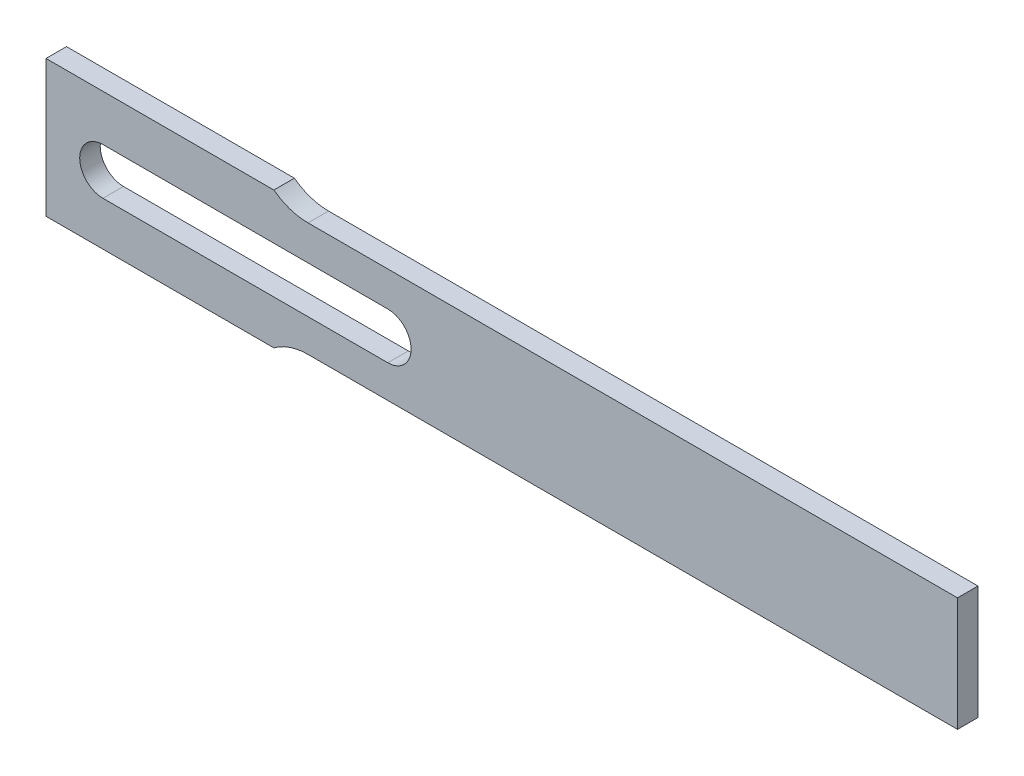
ISO-10303-21;
HEADER;
FILE_DESCRIPTION(('STEP AP214'),'2;1');
FILE_NAME('part.step','',(''),(''),'','','');
FILE_SCHEMA(('AUTOMOTIVE_DESIGN { 1 0 10303 214 1 1 1 1 }'));
ENDSEC;
DATA;
#1=APPLICATION_CONTEXT('core data for automotive mechanical design processes');
#2=APPLICATION_PROTOCOL_DEFINITION('international standard','automotive_design',2000,#1);
#3=PRODUCT_CONTEXT('',#1,'mechanical');
#4=PRODUCT('Part','Part','',(#3));
#5=PRODUCT_RELATED_PRODUCT_CATEGORY('part','',(#4));
#6=PRODUCT_DEFINITION_FORMATION('','',#4);
#7=PRODUCT_DEFINITION_CONTEXT('part definition',#1,'design');
#8=PRODUCT_DEFINITION('design','',#6,#7);
#9=PRODUCT_DEFINITION_SHAPE('','',#8);
#10=(LENGTH_UNIT() NAMED_UNIT(*) SI_UNIT(.MILLI.,.METRE.));
#11=(NAMED_UNIT(*) PLANE_ANGLE_UNIT() SI_UNIT($,.RADIAN.));
#12=(NAMED_UNIT(*) SI_UNIT($,.STERADIAN.) SOLID_ANGLE_UNIT());
#13=UNCERTAINTY_MEASURE_WITH_UNIT(LENGTH_MEASURE(1.E-05),#10,'distance_accuracy_value','');
#14=(GEOMETRIC_REPRESENTATION_CONTEXT(3) GLOBAL_UNCERTAINTY_ASSIGNED_CONTEXT((#13)) GLOBAL_UNIT_ASSIGNED_CONTEXT((#10,
#11,#12)) REPRESENTATION_CONTEXT('',''));
#15=CARTESIAN_POINT('',(0.,0.,0.));
#16=DIRECTION('',(0.,0.,1.));
#17=DIRECTION('',(1.,0.,0.));
#18=AXIS2_PLACEMENT_3D('',#15,#16,#17);
#19=CARTESIAN_POINT('',(23.,9.99999999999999,1.8));
#20=DIRECTION('',(0.,0.,1.));
#21=DIRECTION('',(1.,0.,0.));
#22=AXIS2_PLACEMENT_3D('',#19,#20,#21);
#23=PLANE('',#22);
#24=DIRECTION('',(0.,-1.,0.));
#25=VECTOR('',#24,1.);
#26=CARTESIAN_POINT('',(0.,-6.,1.8));
#27=LINE('',#26,#25);
#28=CARTESIAN_POINT('',(0.,6.,1.8));
#29=VERTEX_POINT('',#28);
#30=CARTESIAN_POINT('',(0.,-6.,1.8));
#31=VERTEX_POINT('',#30);
#32=EDGE_CURVE('E161',#29,#31,#27,.T.);
#33=ORIENTED_EDGE('',*,*,#32,.T.);
#34=DIRECTION('',(1.,0.,0.));
#35=VECTOR('',#34,1.);
#36=CARTESIAN_POINT('',(0.,-6.,1.8));
#37=LINE('',#36,#35);
#38=CARTESIAN_POINT('',(20.,-6.,1.8));
#39=VERTEX_POINT('',#38);
#40=EDGE_CURVE('E164',#31,#39,#37,.T.);
#41=ORIENTED_EDGE('',*,*,#40,.T.);
#42=CARTESIAN_POINT('',(23.,-9.99999999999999,1.8));
#43=DIRECTION('',(0.,0.,-1.));
#44=DIRECTION('',(1.,0.,0.));
#45=AXIS2_PLACEMENT_3D('',#42,#43,#44);
#46=CIRCLE('',#45,4.99999999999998);
#47=CARTESIAN_POINT('',(23.,-5.00000000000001,1.8));
#48=VERTEX_POINT('',#47);
#49=EDGE_CURVE('E167',#39,#48,#46,.T.);
#50=ORIENTED_EDGE('',*,*,#49,.T.);
#51=DIRECTION('',(1.,0.,0.));
#52=VECTOR('',#51,1.);
#53=CARTESIAN_POINT('',(80.,-5.00000000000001,1.8));
#54=LINE('',#53,#52);
#55=CARTESIAN_POINT('',(80.,-5.00000000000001,1.8));
#56=VERTEX_POINT('',#55);
#57=EDGE_CURVE('E169',#48,#56,#54,.T.);
#58=ORIENTED_EDGE('',*,*,#57,.T.);
#59=DIRECTION('',(0.,1.,0.));
#60=VECTOR('',#59,1.);
#61=CARTESIAN_POINT('',(80.,-5.00000000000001,1.8));
#62=LINE('',#61,#60);
#63=CARTESIAN_POINT('',(80.,4.99999999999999,1.8));
#64=VERTEX_POINT('',#63);
#65=EDGE_CURVE('E171',#56,#64,#62,.T.);
#66=ORIENTED_EDGE('',*,*,#65,.T.);
#67=DIRECTION('',(-1.,0.,0.));
#68=VECTOR('',#67,1.);
#69=CARTESIAN_POINT('',(80.,4.99999999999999,1.8));
#70=LINE('',#69,#68);
#71=CARTESIAN_POINT('',(23.,4.99999999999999,1.8));
#72=VERTEX_POINT('',#71);
#73=EDGE_CURVE('E173',#64,#72,#70,.T.);
#74=ORIENTED_EDGE('',*,*,#73,.T.);
#75=CARTESIAN_POINT('',(23.,9.99999999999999,1.8));
#76=DIRECTION('',(0.,0.,-1.));
#77=DIRECTION('',(1.,0.,0.));
#78=AXIS2_PLACEMENT_3D('',#75,#76,#77);
#79=CIRCLE('',#78,5.);
#80=CARTESIAN_POINT('',(20.,6.,1.8));
#81=VERTEX_POINT('',#80);
#82=EDGE_CURVE('E175',#72,#81,#79,.T.);
#83=ORIENTED_EDGE('',*,*,#82,.T.);
#84=DIRECTION('',(-1.,0.,0.));
#85=VECTOR('',#84,1.);
#86=CARTESIAN_POINT('',(0.,6.,1.8));
#87=LINE('',#86,#85);
#88=EDGE_CURVE('E177',#81,#29,#87,.T.);
#89=ORIENTED_EDGE('',*,*,#88,.T.);
#90=EDGE_LOOP('',(#33,#41,#50,#58,#66,#74,#83,#89));
#91=FACE_BOUND('',#90,.T.);
#92=DIRECTION('',(1.,0.,0.));
#93=VECTOR('',#92,1.);
#94=CARTESIAN_POINT('',(5.,-2.13081517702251,1.8));
#95=LINE('',#94,#93);
#96=CARTESIAN_POINT('',(5.,-2.13081517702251,1.8));
#97=VERTEX_POINT('',#96);
#98=CARTESIAN_POINT('',(30.,-2.13081517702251,1.8));
#99=VERTEX_POINT('',#98);
#100=EDGE_CURVE('E133',#97,#99,#95,.T.);
#101=ORIENTED_EDGE('',*,*,#100,.F.);
#102=CARTESIAN_POINT('',(5.,-0.0887839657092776,1.8));
#103=DIRECTION('',(0.,0.,1.));
#104=DIRECTION('',(1.,0.,0.));
#105=AXIS2_PLACEMENT_3D('',#102,#103,#104);
#106=CIRCLE('',#105,2.04203121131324);
#107=CARTESIAN_POINT('',(5.,1.95324724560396,1.8));
#108=VERTEX_POINT('',#107);
#109=EDGE_CURVE('E125',#108,#97,#106,.T.);
#110=ORIENTED_EDGE('',*,*,#109,.F.);
#111=DIRECTION('',(-1.,0.,0.));
#112=VECTOR('',#111,1.);
#113=CARTESIAN_POINT('',(5.,1.95324724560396,1.8));
#114=LINE('',#113,#112);
#115=CARTESIAN_POINT('',(30.,1.95324724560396,1.8));
#116=VERTEX_POINT('',#115);
#117=EDGE_CURVE('E147',#116,#108,#114,.T.);
#118=ORIENTED_EDGE('',*,*,#117,.F.);
#119=CARTESIAN_POINT('',(30.,-0.0887839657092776,1.8));
#120=DIRECTION('',(0.,0.,1.));
#121=DIRECTION('',(1.,0.,0.));
#122=AXIS2_PLACEMENT_3D('',#119,#120,#121);
#123=CIRCLE('',#122,2.04203121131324);
#124=EDGE_CURVE('E145',#99,#116,#123,.T.);
#125=ORIENTED_EDGE('',*,*,#124,.F.);
#126=EDGE_LOOP('',(#101,#110,#118,#125));
#127=FACE_BOUND('',#126,.T.);
#128=ADVANCED_FACE('F36',(#91,#127),#23,.T.);
#129=CARTESIAN_POINT('',(23.,9.99999999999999,0.));
#130=DIRECTION('',(0.,0.,1.));
#131=DIRECTION('',(1.,0.,0.));
#132=AXIS2_PLACEMENT_3D('',#129,#130,#131);
#133=PLANE('',#132);
#134=DIRECTION('',(0.,-1.,0.));
#135=VECTOR('',#134,1.);
#136=CARTESIAN_POINT('',(0.,-6.,0.));
#137=LINE('',#136,#135);
#138=CARTESIAN_POINT('',(0.,6.,0.));
#139=VERTEX_POINT('',#138);
#140=CARTESIAN_POINT('',(0.,-6.,0.));
#141=VERTEX_POINT('',#140);
#142=EDGE_CURVE('E141',#139,#141,#137,.T.);
#143=ORIENTED_EDGE('',*,*,#142,.F.);
#144=DIRECTION('',(-1.,0.,0.));
#145=VECTOR('',#144,1.);
#146=CARTESIAN_POINT('',(0.,6.,0.));
#147=LINE('',#146,#145);
#148=CARTESIAN_POINT('',(20.,6.,0.));
#149=VERTEX_POINT('',#148);
#150=EDGE_CURVE('E165',#149,#139,#147,.T.);
#151=ORIENTED_EDGE('',*,*,#150,.F.);
#152=CARTESIAN_POINT('',(23.,9.99999999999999,0.));
#153=DIRECTION('',(0.,0.,-1.));
#154=DIRECTION('',(1.,0.,0.));
#155=AXIS2_PLACEMENT_3D('',#152,#153,#154);
#156=CIRCLE('',#155,5.);
#157=CARTESIAN_POINT('',(23.,4.99999999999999,0.));
#158=VERTEX_POINT('',#157);
#159=EDGE_CURVE('E192',#158,#149,#156,.T.);
#160=ORIENTED_EDGE('',*,*,#159,.F.);
#161=DIRECTION('',(-1.,0.,0.));
#162=VECTOR('',#161,1.);
#163=CARTESIAN_POINT('',(80.,4.99999999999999,0.));
#164=LINE('',#163,#162);
#165=CARTESIAN_POINT('',(80.,4.99999999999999,0.));
#166=VERTEX_POINT('',#165);
#167=EDGE_CURVE('E190',#166,#158,#164,.T.);
#168=ORIENTED_EDGE('',*,*,#167,.F.);
#169=DIRECTION('',(0.,1.,0.));
#170=VECTOR('',#169,1.);
#171=CARTESIAN_POINT('',(80.,-5.00000000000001,0.));
#172=LINE('',#171,#170);
#173=CARTESIAN_POINT('',(80.,-5.00000000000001,0.));
#174=VERTEX_POINT('',#173);
#175=EDGE_CURVE('E188',#174,#166,#172,.T.);
#176=ORIENTED_EDGE('',*,*,#175,.F.);
#177=DIRECTION('',(1.,0.,0.));
#178=VECTOR('',#177,1.);
#179=CARTESIAN_POINT('',(80.,-5.00000000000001,0.));
#180=LINE('',#179,#178);
#181=CARTESIAN_POINT('',(23.,-5.00000000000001,0.));
#182=VERTEX_POINT('',#181);
#183=EDGE_CURVE('E186',#182,#174,#180,.T.);
#184=ORIENTED_EDGE('',*,*,#183,.F.);
#185=CARTESIAN_POINT('',(23.,-9.99999999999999,0.));
#186=DIRECTION('',(0.,0.,-1.));
#187=DIRECTION('',(1.,0.,0.));
#188=AXIS2_PLACEMENT_3D('',#185,#186,#187);
#189=CIRCLE('',#188,4.99999999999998);
#190=CARTESIAN_POINT('',(20.,-6.,0.));
#191=VERTEX_POINT('',#190);
#192=EDGE_CURVE('E184',#191,#182,#189,.T.);
#193=ORIENTED_EDGE('',*,*,#192,.F.);
#194=DIRECTION('',(1.,0.,0.));
#195=VECTOR('',#194,1.);
#196=CARTESIAN_POINT('',(0.,-6.,0.));
#197=LINE('',#196,#195);
#198=EDGE_CURVE('E182',#141,#191,#197,.T.);
#199=ORIENTED_EDGE('',*,*,#198,.F.);
#200=EDGE_LOOP('',(#143,#151,#160,#168,#176,#184,#193,#199));
#201=FACE_BOUND('',#200,.T.);
#202=CARTESIAN_POINT('',(5.,-0.0887839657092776,0.));
#203=DIRECTION('',(0.,0.,1.));
#204=DIRECTION('',(1.,0.,0.));
#205=AXIS2_PLACEMENT_3D('',#202,#203,#204);
#206=CIRCLE('',#205,2.04203121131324);
#207=CARTESIAN_POINT('',(5.,1.95324724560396,0.));
#208=VERTEX_POINT('',#207);
#209=CARTESIAN_POINT('',(5.,-2.13081517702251,0.));
#210=VERTEX_POINT('',#209);
#211=EDGE_CURVE('E59',#208,#210,#206,.T.);
#212=ORIENTED_EDGE('',*,*,#211,.T.);
#213=DIRECTION('',(1.,0.,0.));
#214=VECTOR('',#213,1.);
#215=CARTESIAN_POINT('',(5.,-2.13081517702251,0.));
#216=LINE('',#215,#214);
#217=CARTESIAN_POINT('',(30.,-2.13081517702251,0.));
#218=VERTEX_POINT('',#217);
#219=EDGE_CURVE('E140',#210,#218,#216,.T.);
#220=ORIENTED_EDGE('',*,*,#219,.T.);
#221=CARTESIAN_POINT('',(30.,-0.0887839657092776,0.));
#222=DIRECTION('',(0.,0.,1.));
#223=DIRECTION('',(1.,0.,0.));
#224=AXIS2_PLACEMENT_3D('',#221,#222,#223);
#225=CIRCLE('',#224,2.04203121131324);
#226=CARTESIAN_POINT('',(30.,1.95324724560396,0.));
#227=VERTEX_POINT('',#226);
#228=EDGE_CURVE('E153',#218,#227,#225,.T.);
#229=ORIENTED_EDGE('',*,*,#228,.T.);
#230=DIRECTION('',(-1.,0.,0.));
#231=VECTOR('',#230,1.);
#232=CARTESIAN_POINT('',(5.,1.95324724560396,0.));
#233=LINE('',#232,#231);
#234=EDGE_CURVE('E134',#227,#208,#233,.T.);
#235=ORIENTED_EDGE('',*,*,#234,.T.);
#236=EDGE_LOOP('',(#212,#220,#229,#235));
#237=FACE_BOUND('',#236,.T.);
#238=ADVANCED_FACE('F222',(#201,#237),#133,.F.);
#239=CARTESIAN_POINT('',(0.,-6.,1.8));
#240=DIRECTION('',(1.,0.,0.));
#241=DIRECTION('',(0.,0.,-1.));
#242=AXIS2_PLACEMENT_3D('',#239,#240,#241);
#243=PLANE('',#242);
#244=ORIENTED_EDGE('',*,*,#142,.T.);
#245=DIRECTION('',(0.,0.,-1.));
#246=VECTOR('',#245,1.);
#247=CARTESIAN_POINT('',(0.,-6.,1.8));
#248=LINE('',#247,#246);
#249=EDGE_CURVE('E11',#31,#141,#248,.T.);
#250=ORIENTED_EDGE('',*,*,#249,.F.);
#251=ORIENTED_EDGE('',*,*,#32,.F.);
#252=DIRECTION('',(0.,0.,-1.));
#253=VECTOR('',#252,1.);
#254=CARTESIAN_POINT('',(0.,6.,1.8));
#255=LINE('',#254,#253);
#256=EDGE_CURVE('E179',#29,#139,#255,.T.);
#257=ORIENTED_EDGE('',*,*,#256,.T.);
#258=EDGE_LOOP('',(#244,#250,#251,#257));
#259=FACE_BOUND('',#258,.T.);
#260=ADVANCED_FACE('F38',(#259),#243,.F.);
#261=CARTESIAN_POINT('',(0.,-6.,1.8));
#262=DIRECTION('',(0.,1.,0.));
#263=DIRECTION('',(0.,0.,1.));
#264=AXIS2_PLACEMENT_3D('',#261,#262,#263);
#265=PLANE('',#264);
#266=ORIENTED_EDGE('',*,*,#198,.T.);
#267=DIRECTION('',(0.,0.,-1.));
#268=VECTOR('',#267,1.);
#269=CARTESIAN_POINT('',(20.,-6.,1.8));
#270=LINE('',#269,#268);
#271=EDGE_CURVE('E44',#39,#191,#270,.T.);
#272=ORIENTED_EDGE('',*,*,#271,.F.);
#273=ORIENTED_EDGE('',*,*,#40,.F.);
#274=ORIENTED_EDGE('',*,*,#249,.T.);
#275=EDGE_LOOP('',(#266,#272,#273,#274));
#276=FACE_BOUND('',#275,.T.);
#277=ADVANCED_FACE('F239',(#276),#265,.F.);
#278=CARTESIAN_POINT('',(23.,-9.99999999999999,1.8));
#279=DIRECTION('',(0.,0.,-1.));
#280=DIRECTION('',(-1.,0.,0.));
#281=AXIS2_PLACEMENT_3D('',#278,#279,#280);
#282=CYLINDRICAL_SURFACE('',#281,4.99999999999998);
#283=ORIENTED_EDGE('',*,*,#192,.T.);
#284=DIRECTION('',(0.,0.,-1.));
#285=VECTOR('',#284,1.);
#286=CARTESIAN_POINT('',(23.,-5.00000000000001,1.8));
#287=LINE('',#286,#285);
#288=EDGE_CURVE('E209',#48,#182,#287,.T.);
#289=ORIENTED_EDGE('',*,*,#288,.F.);
#290=ORIENTED_EDGE('',*,*,#49,.F.);
#291=ORIENTED_EDGE('',*,*,#271,.T.);
#292=EDGE_LOOP('',(#283,#289,#290,#291));
#293=FACE_BOUND('',#292,.T.);
#294=ADVANCED_FACE('F216',(#293),#282,.F.);
#295=CARTESIAN_POINT('',(80.,-5.00000000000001,1.8));
#296=DIRECTION('',(0.,1.,0.));
#297=DIRECTION('',(-1.,0.,0.));
#298=AXIS2_PLACEMENT_3D('',#295,#296,#297);
#299=PLANE('',#298);
#300=ORIENTED_EDGE('',*,*,#183,.T.);
#301=DIRECTION('',(0.,0.,-1.));
#302=VECTOR('',#301,1.);
#303=CARTESIAN_POINT('',(80.,-5.00000000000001,1.8));
#304=LINE('',#303,#302);
#305=EDGE_CURVE('E206',#56,#174,#304,.T.);
#306=ORIENTED_EDGE('',*,*,#305,.F.);
#307=ORIENTED_EDGE('',*,*,#57,.F.);
#308=ORIENTED_EDGE('',*,*,#288,.T.);
#309=EDGE_LOOP('',(#300,#306,#307,#308));
#310=FACE_BOUND('',#309,.T.);
#311=ADVANCED_FACE('F228',(#310),#299,.F.);
#312=CARTESIAN_POINT('',(80.,-5.00000000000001,1.8));
#313=DIRECTION('',(-1.,0.,0.));
#314=DIRECTION('',(0.,0.,1.));
#315=AXIS2_PLACEMENT_3D('',#312,#313,#314);
#316=PLANE('',#315);
#317=ORIENTED_EDGE('',*,*,#175,.T.);
#318=DIRECTION('',(0.,0.,-1.));
#319=VECTOR('',#318,1.);
#320=CARTESIAN_POINT('',(80.,4.99999999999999,1.8));
#321=LINE('',#320,#319);
#322=EDGE_CURVE('E203',#64,#166,#321,.T.);
#323=ORIENTED_EDGE('',*,*,#322,.F.);
#324=ORIENTED_EDGE('',*,*,#65,.F.);
#325=ORIENTED_EDGE('',*,*,#305,.T.);
#326=EDGE_LOOP('',(#317,#323,#324,#325));
#327=FACE_BOUND('',#326,.T.);
#328=ADVANCED_FACE('F232',(#327),#316,.F.);
#329=CARTESIAN_POINT('',(80.,4.99999999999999,1.8));
#330=DIRECTION('',(0.,-1.,0.));
#331=DIRECTION('',(1.,0.,0.));
#332=AXIS2_PLACEMENT_3D('',#329,#330,#331);
#333=PLANE('',#332);
#334=ORIENTED_EDGE('',*,*,#167,.T.);
#335=DIRECTION('',(0.,0.,-1.));
#336=VECTOR('',#335,1.);
#337=CARTESIAN_POINT('',(23.,4.99999999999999,1.8));
#338=LINE('',#337,#336);
#339=EDGE_CURVE('E200',#72,#158,#338,.T.);
#340=ORIENTED_EDGE('',*,*,#339,.F.);
#341=ORIENTED_EDGE('',*,*,#73,.F.);
#342=ORIENTED_EDGE('',*,*,#322,.T.);
#343=EDGE_LOOP('',(#334,#340,#341,#342));
#344=FACE_BOUND('',#343,.T.);
#345=ADVANCED_FACE('F252',(#344),#333,.F.);
#346=CARTESIAN_POINT('',(23.,9.99999999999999,1.8));
#347=DIRECTION('',(0.,0.,-1.));
#348=DIRECTION('',(-1.,0.,0.));
#349=AXIS2_PLACEMENT_3D('',#346,#347,#348);
#350=CYLINDRICAL_SURFACE('',#349,5.);
#351=ORIENTED_EDGE('',*,*,#159,.T.);
#352=DIRECTION('',(0.,0.,-1.));
#353=VECTOR('',#352,1.);
#354=CARTESIAN_POINT('',(20.,6.,1.8));
#355=LINE('',#354,#353);
#356=EDGE_CURVE('E197',#81,#149,#355,.T.);
#357=ORIENTED_EDGE('',*,*,#356,.F.);
#358=ORIENTED_EDGE('',*,*,#82,.F.);
#359=ORIENTED_EDGE('',*,*,#339,.T.);
#360=EDGE_LOOP('',(#351,#357,#358,#359));
#361=FACE_BOUND('',#360,.T.);
#362=ADVANCED_FACE('F250',(#361),#350,.F.);
#363=CARTESIAN_POINT('',(0.,6.,1.8));
#364=DIRECTION('',(0.,-1.,0.));
#365=DIRECTION('',(0.,0.,-1.));
#366=AXIS2_PLACEMENT_3D('',#363,#364,#365);
#367=PLANE('',#366);
#368=ORIENTED_EDGE('',*,*,#150,.T.);
#369=ORIENTED_EDGE('',*,*,#256,.F.);
#370=ORIENTED_EDGE('',*,*,#88,.F.);
#371=ORIENTED_EDGE('',*,*,#356,.T.);
#372=EDGE_LOOP('',(#368,#369,#370,#371));
#373=FACE_BOUND('',#372,.T.);
#374=ADVANCED_FACE('F245',(#373),#367,.F.);
#375=CARTESIAN_POINT('',(5.,-0.0887839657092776,1.8));
#376=DIRECTION('',(0.,0.,-1.));
#377=DIRECTION('',(-1.,0.,0.));
#378=AXIS2_PLACEMENT_3D('',#375,#376,#377);
#379=CYLINDRICAL_SURFACE('',#378,2.04203121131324);
#380=ORIENTED_EDGE('',*,*,#211,.F.);
#381=DIRECTION('',(0.,0.,-1.));
#382=VECTOR('',#381,1.);
#383=CARTESIAN_POINT('',(5.,1.95324724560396,1.8));
#384=LINE('',#383,#382);
#385=EDGE_CURVE('E129',#108,#208,#384,.T.);
#386=ORIENTED_EDGE('',*,*,#385,.F.);
#387=ORIENTED_EDGE('',*,*,#109,.T.);
#388=DIRECTION('',(0.,0.,-1.));
#389=VECTOR('',#388,1.);
#390=CARTESIAN_POINT('',(5.,-2.13081517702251,1.8));
#391=LINE('',#390,#389);
#392=EDGE_CURVE('E128',#97,#210,#391,.T.);
#393=ORIENTED_EDGE('',*,*,#392,.T.);
#394=EDGE_LOOP('',(#380,#386,#387,#393));
#395=FACE_BOUND('',#394,.T.);
#396=ADVANCED_FACE('F127',(#395),#379,.F.);
#397=CARTESIAN_POINT('',(5.,-2.13081517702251,1.8));
#398=DIRECTION('',(0.,1.,0.));
#399=DIRECTION('',(0.,0.,1.));
#400=AXIS2_PLACEMENT_3D('',#397,#398,#399);
#401=PLANE('',#400);
#402=ORIENTED_EDGE('',*,*,#219,.F.);
#403=ORIENTED_EDGE('',*,*,#392,.F.);
#404=ORIENTED_EDGE('',*,*,#100,.T.);
#405=DIRECTION('',(0.,0.,-1.));
#406=VECTOR('',#405,1.);
#407=CARTESIAN_POINT('',(30.,-2.13081517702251,1.8));
#408=LINE('',#407,#406);
#409=EDGE_CURVE('E142',#99,#218,#408,.T.);
#410=ORIENTED_EDGE('',*,*,#409,.T.);
#411=EDGE_LOOP('',(#402,#403,#404,#410));
#412=FACE_BOUND('',#411,.T.);
#413=ADVANCED_FACE('F137',(#412),#401,.T.);
#414=CARTESIAN_POINT('',(30.,-0.0887839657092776,1.8));
#415=DIRECTION('',(0.,0.,-1.));
#416=DIRECTION('',(-1.,0.,0.));
#417=AXIS2_PLACEMENT_3D('',#414,#415,#416);
#418=CYLINDRICAL_SURFACE('',#417,2.04203121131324);
#419=ORIENTED_EDGE('',*,*,#228,.F.);
#420=ORIENTED_EDGE('',*,*,#409,.F.);
#421=ORIENTED_EDGE('',*,*,#124,.T.);
#422=DIRECTION('',(0.,0.,-1.));
#423=VECTOR('',#422,1.);
#424=CARTESIAN_POINT('',(30.,1.95324724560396,1.8));
#425=LINE('',#424,#423);
#426=EDGE_CURVE('E51',#116,#227,#425,.T.);
#427=ORIENTED_EDGE('',*,*,#426,.T.);
#428=EDGE_LOOP('',(#419,#420,#421,#427));
#429=FACE_BOUND('',#428,.T.);
#430=ADVANCED_FACE('F277',(#429),#418,.F.);
#431=CARTESIAN_POINT('',(5.,1.95324724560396,1.8));
#432=DIRECTION('',(0.,-1.,0.));
#433=DIRECTION('',(0.,0.,-1.));
#434=AXIS2_PLACEMENT_3D('',#431,#432,#433);
#435=PLANE('',#434);
#436=ORIENTED_EDGE('',*,*,#234,.F.);
#437=ORIENTED_EDGE('',*,*,#426,.F.);
#438=ORIENTED_EDGE('',*,*,#117,.T.);
#439=ORIENTED_EDGE('',*,*,#385,.T.);
#440=EDGE_LOOP('',(#436,#437,#438,#439));
#441=FACE_BOUND('',#440,.T.);
#442=ADVANCED_FACE('F281',(#441),#435,.T.);
#443=CLOSED_SHELL('',(#128,#238,#260,#277,#294,#311,#328,#345,#362,#374,#396,#413,#430,#442));
#444=MANIFOLD_SOLID_BREP('B2',#443);
#445=ADVANCED_BREP_SHAPE_REPRESENTATION('',(#18,#444),#14);
#446=SHAPE_DEFINITION_REPRESENTATION(#9,#445);
ENDSEC;
END-ISO-10303-21;
